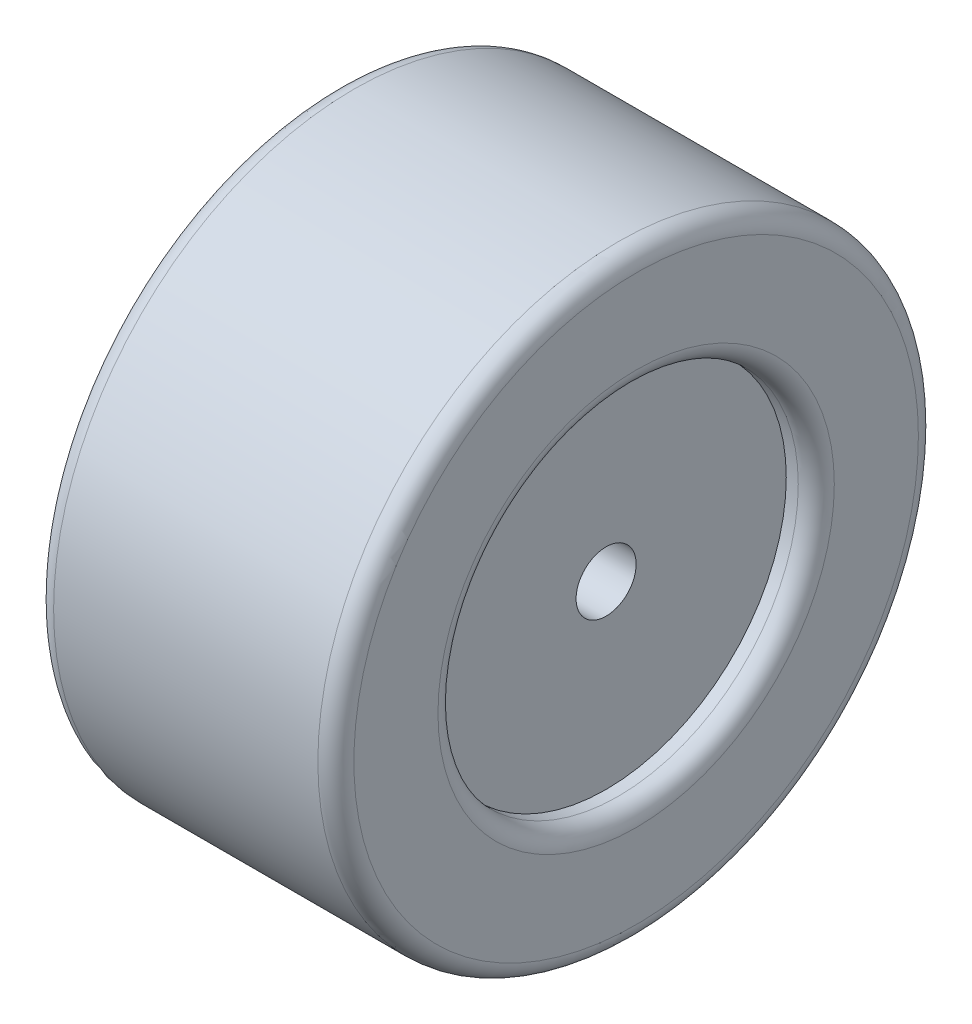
ISO-10303-21;
HEADER;
FILE_DESCRIPTION(('STEP AP214'),'2;1');
FILE_NAME('part.step','',(''),(''),'','','');
FILE_SCHEMA(('AUTOMOTIVE_DESIGN { 1 0 10303 214 1 1 1 1 }'));
ENDSEC;
DATA;
#1=APPLICATION_CONTEXT('core data for automotive mechanical design processes');
#2=APPLICATION_PROTOCOL_DEFINITION('international standard','automotive_design',2000,#1);
#3=PRODUCT_CONTEXT('',#1,'mechanical');
#4=PRODUCT('Part','Part','',(#3));
#5=PRODUCT_RELATED_PRODUCT_CATEGORY('part','',(#4));
#6=PRODUCT_DEFINITION_FORMATION('','',#4);
#7=PRODUCT_DEFINITION_CONTEXT('part definition',#1,'design');
#8=PRODUCT_DEFINITION('design','',#6,#7);
#9=PRODUCT_DEFINITION_SHAPE('','',#8);
#10=(LENGTH_UNIT() NAMED_UNIT(*) SI_UNIT(.MILLI.,.METRE.));
#11=(NAMED_UNIT(*) PLANE_ANGLE_UNIT() SI_UNIT($,.RADIAN.));
#12=(NAMED_UNIT(*) SI_UNIT($,.STERADIAN.) SOLID_ANGLE_UNIT());
#13=UNCERTAINTY_MEASURE_WITH_UNIT(LENGTH_MEASURE(1.E-05),#10,'distance_accuracy_value','');
#14=(GEOMETRIC_REPRESENTATION_CONTEXT(3) GLOBAL_UNCERTAINTY_ASSIGNED_CONTEXT((#13)) GLOBAL_UNIT_ASSIGNED_CONTEXT((#10,
#11,#12)) REPRESENTATION_CONTEXT('',''));
#15=CARTESIAN_POINT('',(0.,0.,0.));
#16=DIRECTION('',(0.,0.,1.));
#17=DIRECTION('',(1.,0.,0.));
#18=AXIS2_PLACEMENT_3D('',#15,#16,#17);
#19=CARTESIAN_POINT('',(5.,0.,0.));
#20=DIRECTION('',(-1.,0.,0.));
#21=DIRECTION('',(0.,0.,1.));
#22=AXIS2_PLACEMENT_3D('',#19,#20,#21);
#23=CYLINDRICAL_SURFACE('',#22,0.5);
#24=CARTESIAN_POINT('',(4.5,0.,0.));
#25=DIRECTION('',(1.,0.,0.));
#26=DIRECTION('',(0.,0.,-1.));
#27=AXIS2_PLACEMENT_3D('',#24,#25,#26);
#28=CIRCLE('',#27,0.5);
#29=CARTESIAN_POINT('',(4.5,0.,-0.5));
#30=VERTEX_POINT('',#29);
#31=EDGE_CURVE('E64',#30,#30,#28,.T.);
#32=ORIENTED_EDGE('',*,*,#31,.T.);
#33=EDGE_LOOP('',(#32));
#34=FACE_BOUND('',#33,.T.);
#35=CARTESIAN_POINT('',(0.5,0.,0.));
#36=DIRECTION('',(-1.,0.,0.));
#37=DIRECTION('',(0.,0.,1.));
#38=AXIS2_PLACEMENT_3D('',#35,#36,#37);
#39=CIRCLE('',#38,0.5);
#40=CARTESIAN_POINT('',(0.5,0.,0.5));
#41=VERTEX_POINT('',#40);
#42=EDGE_CURVE('E65',#41,#41,#39,.T.);
#43=ORIENTED_EDGE('',*,*,#42,.T.);
#44=EDGE_LOOP('',(#43));
#45=FACE_BOUND('',#44,.T.);
#46=ADVANCED_FACE('F32',(#34,#45),#23,.F.);
#47=CARTESIAN_POINT('',(5.,0.,0.));
#48=DIRECTION('',(1.,0.,0.));
#49=DIRECTION('',(0.,0.,-1.));
#50=AXIS2_PLACEMENT_3D('',#47,#48,#49);
#51=PLANE('',#50);
#52=CARTESIAN_POINT('',(5.,0.,0.));
#53=DIRECTION('',(1.,0.,0.));
#54=DIRECTION('',(0.,0.,-1.));
#55=AXIS2_PLACEMENT_3D('',#52,#53,#54);
#56=CIRCLE('',#55,3.3);
#57=CARTESIAN_POINT('',(5.,0.,-3.3));
#58=VERTEX_POINT('',#57);
#59=EDGE_CURVE('E55',#58,#58,#56,.F.);
#60=ORIENTED_EDGE('',*,*,#59,.T.);
#61=EDGE_LOOP('',(#60));
#62=FACE_BOUND('',#61,.T.);
#63=CARTESIAN_POINT('',(5.,0.,0.));
#64=DIRECTION('',(1.,0.,0.));
#65=DIRECTION('',(0.,0.,-1.));
#66=AXIS2_PLACEMENT_3D('',#63,#64,#65);
#67=CIRCLE('',#66,4.7);
#68=CARTESIAN_POINT('',(5.,0.,-4.7));
#69=VERTEX_POINT('',#68);
#70=EDGE_CURVE('E58',#69,#69,#67,.T.);
#71=ORIENTED_EDGE('',*,*,#70,.T.);
#72=EDGE_LOOP('',(#71));
#73=FACE_BOUND('',#72,.T.);
#74=ADVANCED_FACE('F95',(#62,#73),#51,.T.);
#75=CARTESIAN_POINT('',(0.,0.,0.));
#76=DIRECTION('',(1.,0.,0.));
#77=DIRECTION('',(0.,0.,-1.));
#78=AXIS2_PLACEMENT_3D('',#75,#76,#77);
#79=PLANE('',#78);
#80=CARTESIAN_POINT('',(0.,0.,0.));
#81=DIRECTION('',(1.,0.,0.));
#82=DIRECTION('',(0.,0.,-1.));
#83=AXIS2_PLACEMENT_3D('',#80,#81,#82);
#84=CIRCLE('',#83,3.3);
#85=CARTESIAN_POINT('',(0.,0.,-3.3));
#86=VERTEX_POINT('',#85);
#87=EDGE_CURVE('E43',#86,#86,#84,.T.);
#88=ORIENTED_EDGE('',*,*,#87,.T.);
#89=EDGE_LOOP('',(#88));
#90=FACE_BOUND('',#89,.T.);
#91=CARTESIAN_POINT('',(0.,0.,0.));
#92=DIRECTION('',(1.,0.,0.));
#93=DIRECTION('',(0.,0.,-1.));
#94=AXIS2_PLACEMENT_3D('',#91,#92,#93);
#95=CIRCLE('',#94,4.7);
#96=CARTESIAN_POINT('',(0.,0.,-4.7));
#97=VERTEX_POINT('',#96);
#98=EDGE_CURVE('E47',#97,#97,#95,.F.);
#99=ORIENTED_EDGE('',*,*,#98,.T.);
#100=EDGE_LOOP('',(#99));
#101=FACE_BOUND('',#100,.T.);
#102=ADVANCED_FACE('F101',(#90,#101),#79,.F.);
#103=CARTESIAN_POINT('',(5.,0.,0.));
#104=DIRECTION('',(-1.,0.,0.));
#105=DIRECTION('',(0.,0.,1.));
#106=AXIS2_PLACEMENT_3D('',#103,#104,#105);
#107=CYLINDRICAL_SURFACE('',#106,5.);
#108=CARTESIAN_POINT('',(4.7,0.,0.));
#109=DIRECTION('',(1.,0.,0.));
#110=DIRECTION('',(0.,0.,-1.));
#111=AXIS2_PLACEMENT_3D('',#108,#109,#110);
#112=CIRCLE('',#111,5.);
#113=CARTESIAN_POINT('',(4.7,0.,-5.));
#114=VERTEX_POINT('',#113);
#115=EDGE_CURVE('E10',#114,#114,#112,.F.);
#116=ORIENTED_EDGE('',*,*,#115,.T.);
#117=EDGE_LOOP('',(#116));
#118=FACE_BOUND('',#117,.T.);
#119=CARTESIAN_POINT('',(0.3,0.,0.));
#120=DIRECTION('',(1.,0.,0.));
#121=DIRECTION('',(0.,0.,-1.));
#122=AXIS2_PLACEMENT_3D('',#119,#120,#121);
#123=CIRCLE('',#122,5.);
#124=CARTESIAN_POINT('',(0.3,0.,-5.));
#125=VERTEX_POINT('',#124);
#126=EDGE_CURVE('E39',#125,#125,#123,.T.);
#127=ORIENTED_EDGE('',*,*,#126,.T.);
#128=EDGE_LOOP('',(#127));
#129=FACE_BOUND('',#128,.T.);
#130=ADVANCED_FACE('F109',(#118,#129),#107,.T.);
#131=CARTESIAN_POINT('',(4.5,0.,0.));
#132=DIRECTION('',(1.,0.,0.));
#133=DIRECTION('',(0.,0.,-1.));
#134=AXIS2_PLACEMENT_3D('',#131,#132,#133);
#135=CYLINDRICAL_SURFACE('',#134,3.);
#136=CARTESIAN_POINT('',(4.7,0.,0.));
#137=DIRECTION('',(1.,0.,0.));
#138=DIRECTION('',(0.,0.,-1.));
#139=AXIS2_PLACEMENT_3D('',#136,#137,#138);
#140=CIRCLE('',#139,3.);
#141=CARTESIAN_POINT('',(4.7,0.,-3.));
#142=VERTEX_POINT('',#141);
#143=EDGE_CURVE('E61',#142,#142,#140,.T.);
#144=ORIENTED_EDGE('',*,*,#143,.T.);
#145=EDGE_LOOP('',(#144));
#146=FACE_BOUND('',#145,.T.);
#147=CARTESIAN_POINT('',(4.5,0.,0.));
#148=DIRECTION('',(1.,0.,0.));
#149=DIRECTION('',(0.,0.,-1.));
#150=AXIS2_PLACEMENT_3D('',#147,#148,#149);
#151=CIRCLE('',#150,3.);
#152=CARTESIAN_POINT('',(4.5,0.,-3.));
#153=VERTEX_POINT('',#152);
#154=EDGE_CURVE('E68',#153,#153,#151,.T.);
#155=ORIENTED_EDGE('',*,*,#154,.F.);
#156=EDGE_LOOP('',(#155));
#157=FACE_BOUND('',#156,.T.);
#158=ADVANCED_FACE('F91',(#146,#157),#135,.F.);
#159=CARTESIAN_POINT('',(4.5,0.,0.));
#160=DIRECTION('',(1.,0.,0.));
#161=DIRECTION('',(0.,0.,-1.));
#162=AXIS2_PLACEMENT_3D('',#159,#160,#161);
#163=PLANE('',#162);
#164=ORIENTED_EDGE('',*,*,#31,.F.);
#165=EDGE_LOOP('',(#164));
#166=FACE_BOUND('',#165,.T.);
#167=ORIENTED_EDGE('',*,*,#154,.T.);
#168=EDGE_LOOP('',(#167));
#169=FACE_BOUND('',#168,.T.);
#170=ADVANCED_FACE('F81',(#166,#169),#163,.T.);
#171=CARTESIAN_POINT('',(0.5,0.,0.));
#172=DIRECTION('',(-1.,0.,0.));
#173=DIRECTION('',(0.,0.,1.));
#174=AXIS2_PLACEMENT_3D('',#171,#172,#173);
#175=CYLINDRICAL_SURFACE('',#174,3.);
#176=CARTESIAN_POINT('',(0.3,0.,0.));
#177=DIRECTION('',(1.,0.,0.));
#178=DIRECTION('',(0.,0.,-1.));
#179=AXIS2_PLACEMENT_3D('',#176,#177,#178);
#180=CIRCLE('',#179,3.);
#181=CARTESIAN_POINT('',(0.3,0.,-3.));
#182=VERTEX_POINT('',#181);
#183=EDGE_CURVE('E52',#182,#182,#180,.F.);
#184=ORIENTED_EDGE('',*,*,#183,.T.);
#185=EDGE_LOOP('',(#184));
#186=FACE_BOUND('',#185,.T.);
#187=CARTESIAN_POINT('',(0.5,0.,0.));
#188=DIRECTION('',(-1.,0.,0.));
#189=DIRECTION('',(0.,0.,1.));
#190=AXIS2_PLACEMENT_3D('',#187,#188,#189);
#191=CIRCLE('',#190,3.);
#192=CARTESIAN_POINT('',(0.5,0.,3.));
#193=VERTEX_POINT('',#192);
#194=EDGE_CURVE('E69',#193,#193,#191,.T.);
#195=ORIENTED_EDGE('',*,*,#194,.F.);
#196=EDGE_LOOP('',(#195));
#197=FACE_BOUND('',#196,.T.);
#198=ADVANCED_FACE('F79',(#186,#197),#175,.F.);
#199=CARTESIAN_POINT('',(0.5,0.,0.));
#200=DIRECTION('',(-1.,0.,0.));
#201=DIRECTION('',(0.,0.,1.));
#202=AXIS2_PLACEMENT_3D('',#199,#200,#201);
#203=PLANE('',#202);
#204=ORIENTED_EDGE('',*,*,#42,.F.);
#205=EDGE_LOOP('',(#204));
#206=FACE_BOUND('',#205,.T.);
#207=ORIENTED_EDGE('',*,*,#194,.T.);
#208=EDGE_LOOP('',(#207));
#209=FACE_BOUND('',#208,.T.);
#210=ADVANCED_FACE('F77',(#206,#209),#203,.T.);
#211=CARTESIAN_POINT('',(4.7,0.,0.));
#212=DIRECTION('',(1.,0.,0.));
#213=DIRECTION('',(0.,0.,-1.));
#214=AXIS2_PLACEMENT_3D('',#211,#212,#213);
#215=TOROIDAL_SURFACE('',#214,3.3,0.3);
#216=ORIENTED_EDGE('',*,*,#59,.F.);
#217=EDGE_LOOP('',(#216));
#218=FACE_BOUND('',#217,.T.);
#219=ORIENTED_EDGE('',*,*,#143,.F.);
#220=EDGE_LOOP('',(#219));
#221=FACE_BOUND('',#220,.T.);
#222=ADVANCED_FACE('F88',(#218,#221),#215,.T.);
#223=CARTESIAN_POINT('',(0.3,0.,0.));
#224=DIRECTION('',(1.,0.,0.));
#225=DIRECTION('',(0.,0.,-1.));
#226=AXIS2_PLACEMENT_3D('',#223,#224,#225);
#227=TOROIDAL_SURFACE('',#226,3.3,0.3);
#228=ORIENTED_EDGE('',*,*,#87,.F.);
#229=EDGE_LOOP('',(#228));
#230=FACE_BOUND('',#229,.T.);
#231=ORIENTED_EDGE('',*,*,#183,.F.);
#232=EDGE_LOOP('',(#231));
#233=FACE_BOUND('',#232,.T.);
#234=ADVANCED_FACE('F115',(#230,#233),#227,.T.);
#235=CARTESIAN_POINT('',(4.7,0.,0.));
#236=DIRECTION('',(1.,0.,0.));
#237=DIRECTION('',(0.,0.,-1.));
#238=AXIS2_PLACEMENT_3D('',#235,#236,#237);
#239=TOROIDAL_SURFACE('',#238,4.7,0.3);
#240=ORIENTED_EDGE('',*,*,#115,.F.);
#241=EDGE_LOOP('',(#240));
#242=FACE_BOUND('',#241,.T.);
#243=ORIENTED_EDGE('',*,*,#70,.F.);
#244=EDGE_LOOP('',(#243));
#245=FACE_BOUND('',#244,.T.);
#246=ADVANCED_FACE('F118',(#242,#245),#239,.T.);
#247=CARTESIAN_POINT('',(0.3,0.,0.));
#248=DIRECTION('',(1.,0.,0.));
#249=DIRECTION('',(0.,0.,-1.));
#250=AXIS2_PLACEMENT_3D('',#247,#248,#249);
#251=TOROIDAL_SURFACE('',#250,4.7,0.3);
#252=ORIENTED_EDGE('',*,*,#98,.F.);
#253=EDGE_LOOP('',(#252));
#254=FACE_BOUND('',#253,.T.);
#255=ORIENTED_EDGE('',*,*,#126,.F.);
#256=EDGE_LOOP('',(#255));
#257=FACE_BOUND('',#256,.T.);
#258=ADVANCED_FACE('F34',(#254,#257),#251,.T.);
#259=CLOSED_SHELL('',(#46,#74,#102,#130,#158,#170,#198,#210,#222,#234,#246,#258));
#260=MANIFOLD_SOLID_BREP('B2',#259);
#261=ADVANCED_BREP_SHAPE_REPRESENTATION('',(#18,#260),#14);
#262=SHAPE_DEFINITION_REPRESENTATION(#9,#261);
ENDSEC;
END-ISO-10303-21;
